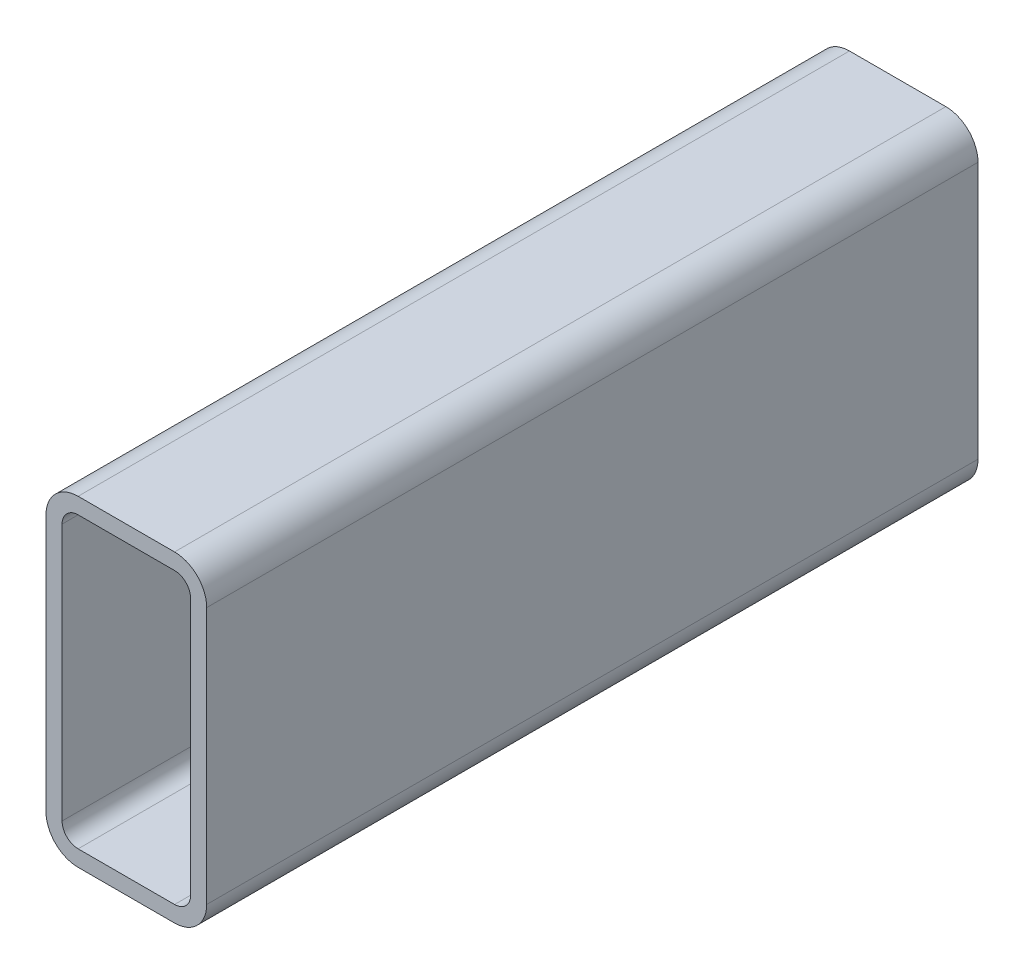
ISO-10303-21;
HEADER;
FILE_DESCRIPTION(('STEP AP214'),'2;1');
FILE_NAME('part.step','',(''),(''),'','','');
FILE_SCHEMA(('AUTOMOTIVE_DESIGN { 1 0 10303 214 1 1 1 1 }'));
ENDSEC;
DATA;
#1=APPLICATION_CONTEXT('core data for automotive mechanical design processes');
#2=APPLICATION_PROTOCOL_DEFINITION('international standard','automotive_design',2000,#1);
#3=PRODUCT_CONTEXT('',#1,'mechanical');
#4=PRODUCT('Part','Part','',(#3));
#5=PRODUCT_RELATED_PRODUCT_CATEGORY('part','',(#4));
#6=PRODUCT_DEFINITION_FORMATION('','',#4);
#7=PRODUCT_DEFINITION_CONTEXT('part definition',#1,'design');
#8=PRODUCT_DEFINITION('design','',#6,#7);
#9=PRODUCT_DEFINITION_SHAPE('','',#8);
#10=(LENGTH_UNIT() NAMED_UNIT(*) SI_UNIT(.MILLI.,.METRE.));
#11=(NAMED_UNIT(*) PLANE_ANGLE_UNIT() SI_UNIT($,.RADIAN.));
#12=(NAMED_UNIT(*) SI_UNIT($,.STERADIAN.) SOLID_ANGLE_UNIT());
#13=UNCERTAINTY_MEASURE_WITH_UNIT(LENGTH_MEASURE(1.E-05),#10,'distance_accuracy_value','');
#14=(GEOMETRIC_REPRESENTATION_CONTEXT(3) GLOBAL_UNCERTAINTY_ASSIGNED_CONTEXT((#13)) GLOBAL_UNIT_ASSIGNED_CONTEXT((#10,
#11,#12)) REPRESENTATION_CONTEXT('',''));
#15=CARTESIAN_POINT('',(0.,0.,0.));
#16=DIRECTION('',(0.,0.,1.));
#17=DIRECTION('',(1.,0.,0.));
#18=AXIS2_PLACEMENT_3D('',#15,#16,#17);
#19=CARTESIAN_POINT('',(15.5960851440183,116.33485662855,304.8));
#20=DIRECTION('',(0.,0.,1.));
#21=DIRECTION('',(1.,0.,0.));
#22=AXIS2_PLACEMENT_3D('',#19,#20,#21);
#23=PLANE('',#22);
#24=CARTESIAN_POINT('',(15.5960851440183,116.33485662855,304.8));
#25=DIRECTION('',(0.,0.,1.));
#26=DIRECTION('',(1.,0.,0.));
#27=AXIS2_PLACEMENT_3D('',#24,#25,#26);
#28=CIRCLE('',#27,12.7);
#29=CARTESIAN_POINT('',(15.5960851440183,129.03485662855,304.8));
#30=VERTEX_POINT('',#29);
#31=CARTESIAN_POINT('',(2.89608514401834,116.33485662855,304.8));
#32=VERTEX_POINT('',#31);
#33=EDGE_CURVE('E211',#30,#32,#28,.T.);
#34=ORIENTED_EDGE('',*,*,#33,.T.);
#35=DIRECTION('',(0.,-1.,0.));
#36=VECTOR('',#35,1.);
#37=CARTESIAN_POINT('',(2.89608514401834,14.73485662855,304.8));
#38=LINE('',#37,#36);
#39=CARTESIAN_POINT('',(2.89608514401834,14.73485662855,304.8));
#40=VERTEX_POINT('',#39);
#41=EDGE_CURVE('E214',#32,#40,#38,.T.);
#42=ORIENTED_EDGE('',*,*,#41,.T.);
#43=CARTESIAN_POINT('',(15.5960851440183,14.73485662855,304.8));
#44=DIRECTION('',(0.,0.,1.));
#45=DIRECTION('',(1.,0.,0.));
#46=AXIS2_PLACEMENT_3D('',#43,#44,#45);
#47=CIRCLE('',#46,12.7);
#48=CARTESIAN_POINT('',(15.5960851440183,2.03485662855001,304.8));
#49=VERTEX_POINT('',#48);
#50=EDGE_CURVE('E217',#40,#49,#47,.T.);
#51=ORIENTED_EDGE('',*,*,#50,.T.);
#52=DIRECTION('',(1.,0.,0.));
#53=VECTOR('',#52,1.);
#54=CARTESIAN_POINT('',(53.6960851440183,2.03485662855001,304.8));
#55=LINE('',#54,#53);
#56=CARTESIAN_POINT('',(53.6960851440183,2.03485662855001,304.8));
#57=VERTEX_POINT('',#56);
#58=EDGE_CURVE('E219',#49,#57,#55,.T.);
#59=ORIENTED_EDGE('',*,*,#58,.T.);
#60=CARTESIAN_POINT('',(53.6960851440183,14.73485662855,304.8));
#61=DIRECTION('',(0.,0.,1.));
#62=DIRECTION('',(1.,0.,0.));
#63=AXIS2_PLACEMENT_3D('',#60,#61,#62);
#64=CIRCLE('',#63,12.7);
#65=CARTESIAN_POINT('',(66.3960851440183,14.73485662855,304.8));
#66=VERTEX_POINT('',#65);
#67=EDGE_CURVE('E221',#57,#66,#64,.T.);
#68=ORIENTED_EDGE('',*,*,#67,.T.);
#69=DIRECTION('',(0.,1.,0.));
#70=VECTOR('',#69,1.);
#71=CARTESIAN_POINT('',(66.3960851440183,116.33485662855,304.8));
#72=LINE('',#71,#70);
#73=CARTESIAN_POINT('',(66.3960851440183,116.33485662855,304.8));
#74=VERTEX_POINT('',#73);
#75=EDGE_CURVE('E223',#66,#74,#72,.T.);
#76=ORIENTED_EDGE('',*,*,#75,.T.);
#77=CARTESIAN_POINT('',(53.6960851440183,116.33485662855,304.8));
#78=DIRECTION('',(0.,0.,1.));
#79=DIRECTION('',(1.,0.,0.));
#80=AXIS2_PLACEMENT_3D('',#77,#78,#79);
#81=CIRCLE('',#80,12.7);
#82=CARTESIAN_POINT('',(53.6960851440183,129.03485662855,304.8));
#83=VERTEX_POINT('',#82);
#84=EDGE_CURVE('E225',#74,#83,#81,.T.);
#85=ORIENTED_EDGE('',*,*,#84,.T.);
#86=DIRECTION('',(-1.,0.,0.));
#87=VECTOR('',#86,1.);
#88=CARTESIAN_POINT('',(15.5960851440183,129.03485662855,304.8));
#89=LINE('',#88,#87);
#90=EDGE_CURVE('E227',#83,#30,#89,.T.);
#91=ORIENTED_EDGE('',*,*,#90,.T.);
#92=EDGE_LOOP('',(#34,#42,#51,#59,#68,#76,#85,#91));
#93=FACE_BOUND('',#92,.T.);
#94=DIRECTION('',(0.,-1.,0.));
#95=VECTOR('',#94,1.);
#96=CARTESIAN_POINT('',(9.24608514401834,14.73485662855,304.8));
#97=LINE('',#96,#95);
#98=CARTESIAN_POINT('',(9.24608514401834,116.33485662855,304.8));
#99=VERTEX_POINT('',#98);
#100=CARTESIAN_POINT('',(9.24608514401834,14.73485662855,304.8));
#101=VERTEX_POINT('',#100);
#102=EDGE_CURVE('E154',#99,#101,#97,.T.);
#103=ORIENTED_EDGE('',*,*,#102,.F.);
#104=CARTESIAN_POINT('',(15.5960851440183,116.33485662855,304.8));
#105=DIRECTION('',(0.,0.,1.));
#106=DIRECTION('',(1.,0.,0.));
#107=AXIS2_PLACEMENT_3D('',#104,#105,#106);
#108=CIRCLE('',#107,6.35000000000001);
#109=CARTESIAN_POINT('',(15.5960851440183,122.68485662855,304.8));
#110=VERTEX_POINT('',#109);
#111=EDGE_CURVE('E146',#110,#99,#108,.T.);
#112=ORIENTED_EDGE('',*,*,#111,.F.);
#113=DIRECTION('',(-1.,0.,0.));
#114=VECTOR('',#113,1.);
#115=CARTESIAN_POINT('',(15.5960851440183,122.68485662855,304.8));
#116=LINE('',#115,#114);
#117=CARTESIAN_POINT('',(53.6960851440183,122.68485662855,304.8));
#118=VERTEX_POINT('',#117);
#119=EDGE_CURVE('E179',#118,#110,#116,.T.);
#120=ORIENTED_EDGE('',*,*,#119,.F.);
#121=CARTESIAN_POINT('',(53.6960851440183,116.33485662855,304.8));
#122=DIRECTION('',(0.,0.,1.));
#123=DIRECTION('',(1.,0.,0.));
#124=AXIS2_PLACEMENT_3D('',#121,#122,#123);
#125=CIRCLE('',#124,6.35000000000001);
#126=CARTESIAN_POINT('',(60.0460851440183,116.33485662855,304.8));
#127=VERTEX_POINT('',#126);
#128=EDGE_CURVE('E177',#127,#118,#125,.T.);
#129=ORIENTED_EDGE('',*,*,#128,.F.);
#130=DIRECTION('',(0.,1.,0.));
#131=VECTOR('',#130,1.);
#132=CARTESIAN_POINT('',(60.0460851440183,116.33485662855,304.8));
#133=LINE('',#132,#131);
#134=CARTESIAN_POINT('',(60.0460851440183,14.73485662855,304.8));
#135=VERTEX_POINT('',#134);
#136=EDGE_CURVE('E175',#135,#127,#133,.T.);
#137=ORIENTED_EDGE('',*,*,#136,.F.);
#138=CARTESIAN_POINT('',(53.6960851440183,14.73485662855,304.8));
#139=DIRECTION('',(0.,0.,1.));
#140=DIRECTION('',(1.,0.,0.));
#141=AXIS2_PLACEMENT_3D('',#138,#139,#140);
#142=CIRCLE('',#141,6.35000000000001);
#143=CARTESIAN_POINT('',(53.6960851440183,8.38485662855,304.8));
#144=VERTEX_POINT('',#143);
#145=EDGE_CURVE('E173',#144,#135,#142,.T.);
#146=ORIENTED_EDGE('',*,*,#145,.F.);
#147=DIRECTION('',(1.,0.,0.));
#148=VECTOR('',#147,1.);
#149=CARTESIAN_POINT('',(53.6960851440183,8.38485662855,304.8));
#150=LINE('',#149,#148);
#151=CARTESIAN_POINT('',(15.5960851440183,8.38485662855,304.8));
#152=VERTEX_POINT('',#151);
#153=EDGE_CURVE('E169',#152,#144,#150,.T.);
#154=ORIENTED_EDGE('',*,*,#153,.F.);
#155=CARTESIAN_POINT('',(15.5960851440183,14.73485662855,304.8));
#156=DIRECTION('',(0.,0.,1.));
#157=DIRECTION('',(1.,0.,0.));
#158=AXIS2_PLACEMENT_3D('',#155,#156,#157);
#159=CIRCLE('',#158,6.35);
#160=EDGE_CURVE('E167',#101,#152,#159,.T.);
#161=ORIENTED_EDGE('',*,*,#160,.F.);
#162=EDGE_LOOP('',(#103,#112,#120,#129,#137,#146,#154,#161));
#163=FACE_BOUND('',#162,.T.);
#164=ADVANCED_FACE('F33',(#93,#163),#23,.T.);
#165=CARTESIAN_POINT('',(15.5960851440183,116.33485662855,0.));
#166=DIRECTION('',(0.,0.,1.));
#167=DIRECTION('',(1.,0.,0.));
#168=AXIS2_PLACEMENT_3D('',#165,#166,#167);
#169=PLANE('',#168);
#170=CARTESIAN_POINT('',(15.5960851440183,116.33485662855,0.));
#171=DIRECTION('',(0.,0.,1.));
#172=DIRECTION('',(1.,0.,0.));
#173=AXIS2_PLACEMENT_3D('',#170,#171,#172);
#174=CIRCLE('',#173,12.7);
#175=CARTESIAN_POINT('',(15.5960851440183,129.03485662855,0.));
#176=VERTEX_POINT('',#175);
#177=CARTESIAN_POINT('',(2.89608514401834,116.33485662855,0.));
#178=VERTEX_POINT('',#177);
#179=EDGE_CURVE('E162',#176,#178,#174,.T.);
#180=ORIENTED_EDGE('',*,*,#179,.F.);
#181=DIRECTION('',(-1.,0.,0.));
#182=VECTOR('',#181,1.);
#183=CARTESIAN_POINT('',(15.5960851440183,129.03485662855,0.));
#184=LINE('',#183,#182);
#185=CARTESIAN_POINT('',(53.6960851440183,129.03485662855,0.));
#186=VERTEX_POINT('',#185);
#187=EDGE_CURVE('E215',#186,#176,#184,.T.);
#188=ORIENTED_EDGE('',*,*,#187,.F.);
#189=CARTESIAN_POINT('',(53.6960851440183,116.33485662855,0.));
#190=DIRECTION('',(0.,0.,1.));
#191=DIRECTION('',(1.,0.,0.));
#192=AXIS2_PLACEMENT_3D('',#189,#190,#191);
#193=CIRCLE('',#192,12.7);
#194=CARTESIAN_POINT('',(66.3960851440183,116.33485662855,0.));
#195=VERTEX_POINT('',#194);
#196=EDGE_CURVE('E242',#195,#186,#193,.T.);
#197=ORIENTED_EDGE('',*,*,#196,.F.);
#198=DIRECTION('',(0.,1.,0.));
#199=VECTOR('',#198,1.);
#200=CARTESIAN_POINT('',(66.3960851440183,116.33485662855,0.));
#201=LINE('',#200,#199);
#202=CARTESIAN_POINT('',(66.3960851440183,14.73485662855,0.));
#203=VERTEX_POINT('',#202);
#204=EDGE_CURVE('E240',#203,#195,#201,.T.);
#205=ORIENTED_EDGE('',*,*,#204,.F.);
#206=CARTESIAN_POINT('',(53.6960851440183,14.73485662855,0.));
#207=DIRECTION('',(0.,0.,1.));
#208=DIRECTION('',(1.,0.,0.));
#209=AXIS2_PLACEMENT_3D('',#206,#207,#208);
#210=CIRCLE('',#209,12.7);
#211=CARTESIAN_POINT('',(53.6960851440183,2.03485662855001,0.));
#212=VERTEX_POINT('',#211);
#213=EDGE_CURVE('E238',#212,#203,#210,.T.);
#214=ORIENTED_EDGE('',*,*,#213,.F.);
#215=DIRECTION('',(1.,0.,0.));
#216=VECTOR('',#215,1.);
#217=CARTESIAN_POINT('',(53.6960851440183,2.03485662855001,0.));
#218=LINE('',#217,#216);
#219=CARTESIAN_POINT('',(15.5960851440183,2.03485662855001,0.));
#220=VERTEX_POINT('',#219);
#221=EDGE_CURVE('E236',#220,#212,#218,.T.);
#222=ORIENTED_EDGE('',*,*,#221,.F.);
#223=CARTESIAN_POINT('',(15.5960851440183,14.73485662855,0.));
#224=DIRECTION('',(0.,0.,1.));
#225=DIRECTION('',(1.,0.,0.));
#226=AXIS2_PLACEMENT_3D('',#223,#224,#225);
#227=CIRCLE('',#226,12.7);
#228=CARTESIAN_POINT('',(2.89608514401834,14.73485662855,0.));
#229=VERTEX_POINT('',#228);
#230=EDGE_CURVE('E234',#229,#220,#227,.T.);
#231=ORIENTED_EDGE('',*,*,#230,.F.);
#232=DIRECTION('',(0.,-1.,0.));
#233=VECTOR('',#232,1.);
#234=CARTESIAN_POINT('',(2.89608514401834,14.73485662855,0.));
#235=LINE('',#234,#233);
#236=EDGE_CURVE('E232',#178,#229,#235,.T.);
#237=ORIENTED_EDGE('',*,*,#236,.F.);
#238=EDGE_LOOP('',(#180,#188,#197,#205,#214,#222,#231,#237));
#239=FACE_BOUND('',#238,.T.);
#240=CARTESIAN_POINT('',(15.5960851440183,116.33485662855,0.));
#241=DIRECTION('',(0.,0.,1.));
#242=DIRECTION('',(1.,0.,0.));
#243=AXIS2_PLACEMENT_3D('',#240,#241,#242);
#244=CIRCLE('',#243,6.35000000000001);
#245=CARTESIAN_POINT('',(15.5960851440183,122.68485662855,0.));
#246=VERTEX_POINT('',#245);
#247=CARTESIAN_POINT('',(9.24608514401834,116.33485662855,0.));
#248=VERTEX_POINT('',#247);
#249=EDGE_CURVE('E56',#246,#248,#244,.T.);
#250=ORIENTED_EDGE('',*,*,#249,.T.);
#251=DIRECTION('',(0.,-1.,0.));
#252=VECTOR('',#251,1.);
#253=CARTESIAN_POINT('',(9.24608514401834,14.73485662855,0.));
#254=LINE('',#253,#252);
#255=CARTESIAN_POINT('',(9.24608514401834,14.73485662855,0.));
#256=VERTEX_POINT('',#255);
#257=EDGE_CURVE('E161',#248,#256,#254,.T.);
#258=ORIENTED_EDGE('',*,*,#257,.T.);
#259=CARTESIAN_POINT('',(15.5960851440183,14.73485662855,0.));
#260=DIRECTION('',(0.,0.,1.));
#261=DIRECTION('',(1.,0.,0.));
#262=AXIS2_PLACEMENT_3D('',#259,#260,#261);
#263=CIRCLE('',#262,6.35);
#264=CARTESIAN_POINT('',(15.5960851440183,8.38485662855,0.));
#265=VERTEX_POINT('',#264);
#266=EDGE_CURVE('E183',#256,#265,#263,.T.);
#267=ORIENTED_EDGE('',*,*,#266,.T.);
#268=DIRECTION('',(1.,0.,0.));
#269=VECTOR('',#268,1.);
#270=CARTESIAN_POINT('',(53.6960851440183,8.38485662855,0.));
#271=LINE('',#270,#269);
#272=CARTESIAN_POINT('',(53.6960851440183,8.38485662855,0.));
#273=VERTEX_POINT('',#272);
#274=EDGE_CURVE('E186',#265,#273,#271,.T.);
#275=ORIENTED_EDGE('',*,*,#274,.T.);
#276=CARTESIAN_POINT('',(53.6960851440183,14.73485662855,0.));
#277=DIRECTION('',(0.,0.,1.));
#278=DIRECTION('',(1.,0.,0.));
#279=AXIS2_PLACEMENT_3D('',#276,#277,#278);
#280=CIRCLE('',#279,6.35000000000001);
#281=CARTESIAN_POINT('',(60.0460851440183,14.73485662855,0.));
#282=VERTEX_POINT('',#281);
#283=EDGE_CURVE('E189',#273,#282,#280,.T.);
#284=ORIENTED_EDGE('',*,*,#283,.T.);
#285=DIRECTION('',(0.,1.,0.));
#286=VECTOR('',#285,1.);
#287=CARTESIAN_POINT('',(60.0460851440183,116.33485662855,0.));
#288=LINE('',#287,#286);
#289=CARTESIAN_POINT('',(60.0460851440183,116.33485662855,0.));
#290=VERTEX_POINT('',#289);
#291=EDGE_CURVE('E192',#282,#290,#288,.T.);
#292=ORIENTED_EDGE('',*,*,#291,.T.);
#293=CARTESIAN_POINT('',(53.6960851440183,116.33485662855,0.));
#294=DIRECTION('',(0.,0.,1.));
#295=DIRECTION('',(1.,0.,0.));
#296=AXIS2_PLACEMENT_3D('',#293,#294,#295);
#297=CIRCLE('',#296,6.35000000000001);
#298=CARTESIAN_POINT('',(53.6960851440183,122.68485662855,0.));
#299=VERTEX_POINT('',#298);
#300=EDGE_CURVE('E195',#290,#299,#297,.T.);
#301=ORIENTED_EDGE('',*,*,#300,.T.);
#302=DIRECTION('',(-1.,0.,0.));
#303=VECTOR('',#302,1.);
#304=CARTESIAN_POINT('',(15.5960851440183,122.68485662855,0.));
#305=LINE('',#304,#303);
#306=EDGE_CURVE('E155',#299,#246,#305,.T.);
#307=ORIENTED_EDGE('',*,*,#306,.T.);
#308=EDGE_LOOP('',(#250,#258,#267,#275,#284,#292,#301,#307));
#309=FACE_BOUND('',#308,.T.);
#310=ADVANCED_FACE('F272',(#239,#309),#169,.F.);
#311=CARTESIAN_POINT('',(15.5960851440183,116.33485662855,304.8));
#312=DIRECTION('',(0.,0.,-1.));
#313=DIRECTION('',(-1.,0.,0.));
#314=AXIS2_PLACEMENT_3D('',#311,#312,#313);
#315=CYLINDRICAL_SURFACE('',#314,12.7);
#316=ORIENTED_EDGE('',*,*,#179,.T.);
#317=DIRECTION('',(0.,0.,-1.));
#318=VECTOR('',#317,1.);
#319=CARTESIAN_POINT('',(2.89608514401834,116.33485662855,304.8));
#320=LINE('',#319,#318);
#321=EDGE_CURVE('E11',#32,#178,#320,.T.);
#322=ORIENTED_EDGE('',*,*,#321,.F.);
#323=ORIENTED_EDGE('',*,*,#33,.F.);
#324=DIRECTION('',(0.,0.,-1.));
#325=VECTOR('',#324,1.);
#326=CARTESIAN_POINT('',(15.5960851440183,129.03485662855,304.8));
#327=LINE('',#326,#325);
#328=EDGE_CURVE('E229',#30,#176,#327,.T.);
#329=ORIENTED_EDGE('',*,*,#328,.T.);
#330=EDGE_LOOP('',(#316,#322,#323,#329));
#331=FACE_BOUND('',#330,.T.);
#332=ADVANCED_FACE('F35',(#331),#315,.T.);
#333=CARTESIAN_POINT('',(2.89608514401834,14.73485662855,304.8));
#334=DIRECTION('',(1.,0.,0.));
#335=DIRECTION('',(0.,0.,-1.));
#336=AXIS2_PLACEMENT_3D('',#333,#334,#335);
#337=PLANE('',#336);
#338=ORIENTED_EDGE('',*,*,#236,.T.);
#339=DIRECTION('',(0.,0.,-1.));
#340=VECTOR('',#339,1.);
#341=CARTESIAN_POINT('',(2.89608514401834,14.73485662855,304.8));
#342=LINE('',#341,#340);
#343=EDGE_CURVE('E41',#40,#229,#342,.T.);
#344=ORIENTED_EDGE('',*,*,#343,.F.);
#345=ORIENTED_EDGE('',*,*,#41,.F.);
#346=ORIENTED_EDGE('',*,*,#321,.T.);
#347=EDGE_LOOP('',(#338,#344,#345,#346));
#348=FACE_BOUND('',#347,.T.);
#349=ADVANCED_FACE('F289',(#348),#337,.F.);
#350=CARTESIAN_POINT('',(15.5960851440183,14.73485662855,304.8));
#351=DIRECTION('',(0.,0.,-1.));
#352=DIRECTION('',(-1.,0.,0.));
#353=AXIS2_PLACEMENT_3D('',#350,#351,#352);
#354=CYLINDRICAL_SURFACE('',#353,12.7);
#355=ORIENTED_EDGE('',*,*,#230,.T.);
#356=DIRECTION('',(0.,0.,-1.));
#357=VECTOR('',#356,1.);
#358=CARTESIAN_POINT('',(15.5960851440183,2.03485662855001,304.8));
#359=LINE('',#358,#357);
#360=EDGE_CURVE('E259',#49,#220,#359,.T.);
#361=ORIENTED_EDGE('',*,*,#360,.F.);
#362=ORIENTED_EDGE('',*,*,#50,.F.);
#363=ORIENTED_EDGE('',*,*,#343,.T.);
#364=EDGE_LOOP('',(#355,#361,#362,#363));
#365=FACE_BOUND('',#364,.T.);
#366=ADVANCED_FACE('F266',(#365),#354,.T.);
#367=CARTESIAN_POINT('',(53.6960851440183,2.03485662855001,304.8));
#368=DIRECTION('',(0.,1.,0.));
#369=DIRECTION('',(0.,0.,1.));
#370=AXIS2_PLACEMENT_3D('',#367,#368,#369);
#371=PLANE('',#370);
#372=ORIENTED_EDGE('',*,*,#221,.T.);
#373=DIRECTION('',(0.,0.,-1.));
#374=VECTOR('',#373,1.);
#375=CARTESIAN_POINT('',(53.6960851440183,2.03485662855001,304.8));
#376=LINE('',#375,#374);
#377=EDGE_CURVE('E256',#57,#212,#376,.T.);
#378=ORIENTED_EDGE('',*,*,#377,.F.);
#379=ORIENTED_EDGE('',*,*,#58,.F.);
#380=ORIENTED_EDGE('',*,*,#360,.T.);
#381=EDGE_LOOP('',(#372,#378,#379,#380));
#382=FACE_BOUND('',#381,.T.);
#383=ADVANCED_FACE('F278',(#382),#371,.F.);
#384=CARTESIAN_POINT('',(53.6960851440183,14.73485662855,304.8));
#385=DIRECTION('',(0.,0.,-1.));
#386=DIRECTION('',(-1.,0.,0.));
#387=AXIS2_PLACEMENT_3D('',#384,#385,#386);
#388=CYLINDRICAL_SURFACE('',#387,12.7);
#389=ORIENTED_EDGE('',*,*,#213,.T.);
#390=DIRECTION('',(0.,0.,-1.));
#391=VECTOR('',#390,1.);
#392=CARTESIAN_POINT('',(66.3960851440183,14.73485662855,304.8));
#393=LINE('',#392,#391);
#394=EDGE_CURVE('E253',#66,#203,#393,.T.);
#395=ORIENTED_EDGE('',*,*,#394,.F.);
#396=ORIENTED_EDGE('',*,*,#67,.F.);
#397=ORIENTED_EDGE('',*,*,#377,.T.);
#398=EDGE_LOOP('',(#389,#395,#396,#397));
#399=FACE_BOUND('',#398,.T.);
#400=ADVANCED_FACE('F282',(#399),#388,.T.);
#401=CARTESIAN_POINT('',(66.3960851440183,116.33485662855,304.8));
#402=DIRECTION('',(-1.,0.,0.));
#403=DIRECTION('',(0.,0.,1.));
#404=AXIS2_PLACEMENT_3D('',#401,#402,#403);
#405=PLANE('',#404);
#406=ORIENTED_EDGE('',*,*,#204,.T.);
#407=DIRECTION('',(0.,0.,-1.));
#408=VECTOR('',#407,1.);
#409=CARTESIAN_POINT('',(66.3960851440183,116.33485662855,304.8));
#410=LINE('',#409,#408);
#411=EDGE_CURVE('E250',#74,#195,#410,.T.);
#412=ORIENTED_EDGE('',*,*,#411,.F.);
#413=ORIENTED_EDGE('',*,*,#75,.F.);
#414=ORIENTED_EDGE('',*,*,#394,.T.);
#415=EDGE_LOOP('',(#406,#412,#413,#414));
#416=FACE_BOUND('',#415,.T.);
#417=ADVANCED_FACE('F302',(#416),#405,.F.);
#418=CARTESIAN_POINT('',(53.6960851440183,116.33485662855,304.8));
#419=DIRECTION('',(0.,0.,-1.));
#420=DIRECTION('',(-1.,0.,0.));
#421=AXIS2_PLACEMENT_3D('',#418,#419,#420);
#422=CYLINDRICAL_SURFACE('',#421,12.7);
#423=ORIENTED_EDGE('',*,*,#196,.T.);
#424=DIRECTION('',(0.,0.,-1.));
#425=VECTOR('',#424,1.);
#426=CARTESIAN_POINT('',(53.6960851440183,129.03485662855,304.8));
#427=LINE('',#426,#425);
#428=EDGE_CURVE('E247',#83,#186,#427,.T.);
#429=ORIENTED_EDGE('',*,*,#428,.F.);
#430=ORIENTED_EDGE('',*,*,#84,.F.);
#431=ORIENTED_EDGE('',*,*,#411,.T.);
#432=EDGE_LOOP('',(#423,#429,#430,#431));
#433=FACE_BOUND('',#432,.T.);
#434=ADVANCED_FACE('F300',(#433),#422,.T.);
#435=CARTESIAN_POINT('',(15.5960851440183,129.03485662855,304.8));
#436=DIRECTION('',(0.,-1.,0.));
#437=DIRECTION('',(0.,0.,-1.));
#438=AXIS2_PLACEMENT_3D('',#435,#436,#437);
#439=PLANE('',#438);
#440=ORIENTED_EDGE('',*,*,#187,.T.);
#441=ORIENTED_EDGE('',*,*,#328,.F.);
#442=ORIENTED_EDGE('',*,*,#90,.F.);
#443=ORIENTED_EDGE('',*,*,#428,.T.);
#444=EDGE_LOOP('',(#440,#441,#442,#443));
#445=FACE_BOUND('',#444,.T.);
#446=ADVANCED_FACE('F295',(#445),#439,.F.);
#447=CARTESIAN_POINT('',(15.5960851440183,116.33485662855,304.8));
#448=DIRECTION('',(0.,0.,-1.));
#449=DIRECTION('',(-1.,0.,0.));
#450=AXIS2_PLACEMENT_3D('',#447,#448,#449);
#451=CYLINDRICAL_SURFACE('',#450,6.35000000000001);
#452=ORIENTED_EDGE('',*,*,#249,.F.);
#453=DIRECTION('',(0.,0.,-1.));
#454=VECTOR('',#453,1.);
#455=CARTESIAN_POINT('',(15.5960851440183,122.68485662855,304.8));
#456=LINE('',#455,#454);
#457=EDGE_CURVE('E150',#110,#246,#456,.T.);
#458=ORIENTED_EDGE('',*,*,#457,.F.);
#459=ORIENTED_EDGE('',*,*,#111,.T.);
#460=DIRECTION('',(0.,0.,-1.));
#461=VECTOR('',#460,1.);
#462=CARTESIAN_POINT('',(9.24608514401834,116.33485662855,304.8));
#463=LINE('',#462,#461);
#464=EDGE_CURVE('E149',#99,#248,#463,.T.);
#465=ORIENTED_EDGE('',*,*,#464,.T.);
#466=EDGE_LOOP('',(#452,#458,#459,#465));
#467=FACE_BOUND('',#466,.T.);
#468=ADVANCED_FACE('F148',(#467),#451,.F.);
#469=CARTESIAN_POINT('',(9.24608514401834,14.73485662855,304.8));
#470=DIRECTION('',(1.,0.,0.));
#471=DIRECTION('',(0.,0.,-1.));
#472=AXIS2_PLACEMENT_3D('',#469,#470,#471);
#473=PLANE('',#472);
#474=ORIENTED_EDGE('',*,*,#257,.F.);
#475=ORIENTED_EDGE('',*,*,#464,.F.);
#476=ORIENTED_EDGE('',*,*,#102,.T.);
#477=DIRECTION('',(0.,0.,-1.));
#478=VECTOR('',#477,1.);
#479=CARTESIAN_POINT('',(9.24608514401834,14.73485662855,304.8));
#480=LINE('',#479,#478);
#481=EDGE_CURVE('E163',#101,#256,#480,.T.);
#482=ORIENTED_EDGE('',*,*,#481,.T.);
#483=EDGE_LOOP('',(#474,#475,#476,#482));
#484=FACE_BOUND('',#483,.T.);
#485=ADVANCED_FACE('F158',(#484),#473,.T.);
#486=CARTESIAN_POINT('',(15.5960851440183,14.73485662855,304.8));
#487=DIRECTION('',(0.,0.,-1.));
#488=DIRECTION('',(-1.,0.,0.));
#489=AXIS2_PLACEMENT_3D('',#486,#487,#488);
#490=CYLINDRICAL_SURFACE('',#489,6.35);
#491=ORIENTED_EDGE('',*,*,#266,.F.);
#492=ORIENTED_EDGE('',*,*,#481,.F.);
#493=ORIENTED_EDGE('',*,*,#160,.T.);
#494=DIRECTION('',(0.,0.,-1.));
#495=VECTOR('',#494,1.);
#496=CARTESIAN_POINT('',(15.5960851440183,8.38485662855,304.8));
#497=LINE('',#496,#495);
#498=EDGE_CURVE('E208',#152,#265,#497,.T.);
#499=ORIENTED_EDGE('',*,*,#498,.T.);
#500=EDGE_LOOP('',(#491,#492,#493,#499));
#501=FACE_BOUND('',#500,.T.);
#502=ADVANCED_FACE('F327',(#501),#490,.F.);
#503=CARTESIAN_POINT('',(53.6960851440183,8.38485662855,304.8));
#504=DIRECTION('',(0.,1.,0.));
#505=DIRECTION('',(0.,0.,1.));
#506=AXIS2_PLACEMENT_3D('',#503,#504,#505);
#507=PLANE('',#506);
#508=ORIENTED_EDGE('',*,*,#274,.F.);
#509=ORIENTED_EDGE('',*,*,#498,.F.);
#510=ORIENTED_EDGE('',*,*,#153,.T.);
#511=DIRECTION('',(0.,0.,-1.));
#512=VECTOR('',#511,1.);
#513=CARTESIAN_POINT('',(53.6960851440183,8.38485662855,304.8));
#514=LINE('',#513,#512);
#515=EDGE_CURVE('E206',#144,#273,#514,.T.);
#516=ORIENTED_EDGE('',*,*,#515,.T.);
#517=EDGE_LOOP('',(#508,#509,#510,#516));
#518=FACE_BOUND('',#517,.T.);
#519=ADVANCED_FACE('F331',(#518),#507,.T.);
#520=CARTESIAN_POINT('',(53.6960851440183,14.73485662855,304.8));
#521=DIRECTION('',(0.,0.,-1.));
#522=DIRECTION('',(-1.,0.,0.));
#523=AXIS2_PLACEMENT_3D('',#520,#521,#522);
#524=CYLINDRICAL_SURFACE('',#523,6.35000000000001);
#525=ORIENTED_EDGE('',*,*,#283,.F.);
#526=ORIENTED_EDGE('',*,*,#515,.F.);
#527=ORIENTED_EDGE('',*,*,#145,.T.);
#528=DIRECTION('',(0.,0.,-1.));
#529=VECTOR('',#528,1.);
#530=CARTESIAN_POINT('',(60.0460851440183,14.73485662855,304.8));
#531=LINE('',#530,#529);
#532=EDGE_CURVE('E204',#135,#282,#531,.T.);
#533=ORIENTED_EDGE('',*,*,#532,.T.);
#534=EDGE_LOOP('',(#525,#526,#527,#533));
#535=FACE_BOUND('',#534,.T.);
#536=ADVANCED_FACE('F337',(#535),#524,.F.);
#537=CARTESIAN_POINT('',(60.0460851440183,116.33485662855,304.8));
#538=DIRECTION('',(-1.,0.,0.));
#539=DIRECTION('',(0.,0.,1.));
#540=AXIS2_PLACEMENT_3D('',#537,#538,#539);
#541=PLANE('',#540);
#542=ORIENTED_EDGE('',*,*,#291,.F.);
#543=ORIENTED_EDGE('',*,*,#532,.F.);
#544=ORIENTED_EDGE('',*,*,#136,.T.);
#545=DIRECTION('',(0.,0.,-1.));
#546=VECTOR('',#545,1.);
#547=CARTESIAN_POINT('',(60.0460851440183,116.33485662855,304.8));
#548=LINE('',#547,#546);
#549=EDGE_CURVE('E202',#127,#290,#548,.T.);
#550=ORIENTED_EDGE('',*,*,#549,.T.);
#551=EDGE_LOOP('',(#542,#543,#544,#550));
#552=FACE_BOUND('',#551,.T.);
#553=ADVANCED_FACE('F341',(#552),#541,.T.);
#554=CARTESIAN_POINT('',(53.6960851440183,116.33485662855,304.8));
#555=DIRECTION('',(0.,0.,-1.));
#556=DIRECTION('',(-1.,0.,0.));
#557=AXIS2_PLACEMENT_3D('',#554,#555,#556);
#558=CYLINDRICAL_SURFACE('',#557,6.35000000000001);
#559=ORIENTED_EDGE('',*,*,#300,.F.);
#560=ORIENTED_EDGE('',*,*,#549,.F.);
#561=ORIENTED_EDGE('',*,*,#128,.T.);
#562=DIRECTION('',(0.,0.,-1.));
#563=VECTOR('',#562,1.);
#564=CARTESIAN_POINT('',(53.6960851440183,122.68485662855,304.8));
#565=LINE('',#564,#563);
#566=EDGE_CURVE('E48',#118,#299,#565,.T.);
#567=ORIENTED_EDGE('',*,*,#566,.T.);
#568=EDGE_LOOP('',(#559,#560,#561,#567));
#569=FACE_BOUND('',#568,.T.);
#570=ADVANCED_FACE('F345',(#569),#558,.F.);
#571=CARTESIAN_POINT('',(15.5960851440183,122.68485662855,304.8));
#572=DIRECTION('',(0.,-1.,0.));
#573=DIRECTION('',(0.,0.,-1.));
#574=AXIS2_PLACEMENT_3D('',#571,#572,#573);
#575=PLANE('',#574);
#576=ORIENTED_EDGE('',*,*,#306,.F.);
#577=ORIENTED_EDGE('',*,*,#566,.F.);
#578=ORIENTED_EDGE('',*,*,#119,.T.);
#579=ORIENTED_EDGE('',*,*,#457,.T.);
#580=EDGE_LOOP('',(#576,#577,#578,#579));
#581=FACE_BOUND('',#580,.T.);
#582=ADVANCED_FACE('F349',(#581),#575,.T.);
#583=CLOSED_SHELL('',(#164,#310,#332,#349,#366,#383,#400,#417,#434,#446,#468,#485,#502,#519,
#536,#553,#570,#582));
#584=MANIFOLD_SOLID_BREP('B2',#583);
#585=ADVANCED_BREP_SHAPE_REPRESENTATION('',(#18,#584),#14);
#586=SHAPE_DEFINITION_REPRESENTATION(#9,#585);
ENDSEC;
END-ISO-10303-21;
